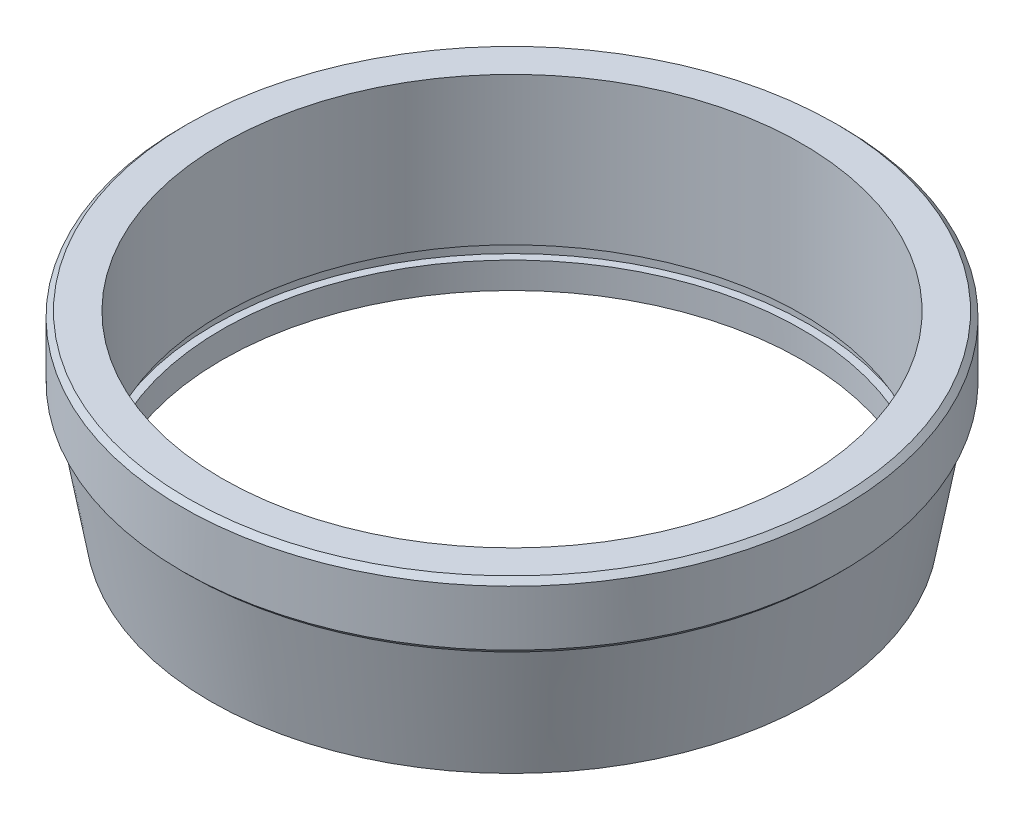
ISO-10303-21;
HEADER;
FILE_DESCRIPTION(('STEP AP214'),'2;1');
FILE_NAME('part.step','',(''),(''),'','','');
FILE_SCHEMA(('AUTOMOTIVE_DESIGN { 1 0 10303 214 1 1 1 1 }'));
ENDSEC;
DATA;
#1=APPLICATION_CONTEXT('core data for automotive mechanical design processes');
#2=APPLICATION_PROTOCOL_DEFINITION('international standard','automotive_design',2000,#1);
#3=PRODUCT_CONTEXT('',#1,'mechanical');
#4=PRODUCT('Part','Part','',(#3));
#5=PRODUCT_RELATED_PRODUCT_CATEGORY('part','',(#4));
#6=PRODUCT_DEFINITION_FORMATION('','',#4);
#7=PRODUCT_DEFINITION_CONTEXT('part definition',#1,'design');
#8=PRODUCT_DEFINITION('design','',#6,#7);
#9=PRODUCT_DEFINITION_SHAPE('','',#8);
#10=(LENGTH_UNIT() NAMED_UNIT(*) SI_UNIT(.MILLI.,.METRE.));
#11=(NAMED_UNIT(*) PLANE_ANGLE_UNIT() SI_UNIT($,.RADIAN.));
#12=(NAMED_UNIT(*) SI_UNIT($,.STERADIAN.) SOLID_ANGLE_UNIT());
#13=UNCERTAINTY_MEASURE_WITH_UNIT(LENGTH_MEASURE(1.E-05),#10,'distance_accuracy_value','');
#14=(GEOMETRIC_REPRESENTATION_CONTEXT(3) GLOBAL_UNCERTAINTY_ASSIGNED_CONTEXT((#13)) GLOBAL_UNIT_ASSIGNED_CONTEXT((#10,
#11,#12)) REPRESENTATION_CONTEXT('',''));
#15=CARTESIAN_POINT('',(0.,0.,0.));
#16=DIRECTION('',(0.,0.,1.));
#17=DIRECTION('',(1.,0.,0.));
#18=AXIS2_PLACEMENT_3D('',#15,#16,#17);
#19=CARTESIAN_POINT('',(0.,0.,0.));
#20=DIRECTION('',(0.,1.,0.));
#21=DIRECTION('',(0.,0.,1.));
#22=AXIS2_PLACEMENT_3D('',#19,#20,#21);
#23=CYLINDRICAL_SURFACE('',#22,11.);
#24=CARTESIAN_POINT('',(0.,-3.1,0.));
#25=DIRECTION('',(0.,1.,0.));
#26=DIRECTION('',(0.,0.,1.));
#27=AXIS2_PLACEMENT_3D('',#24,#25,#26);
#28=CIRCLE('',#27,11.);
#29=CARTESIAN_POINT('',(0.,-3.1,11.));
#30=VERTEX_POINT('',#29);
#31=EDGE_CURVE('E66',#30,#30,#28,.T.);
#32=ORIENTED_EDGE('',*,*,#31,.F.);
#33=EDGE_LOOP('',(#32));
#34=FACE_BOUND('',#33,.T.);
#35=CARTESIAN_POINT('',(0.,2.5,0.));
#36=DIRECTION('',(0.,1.,0.));
#37=DIRECTION('',(0.,0.,1.));
#38=AXIS2_PLACEMENT_3D('',#35,#36,#37);
#39=CIRCLE('',#38,11.);
#40=CARTESIAN_POINT('',(0.,2.5,11.));
#41=VERTEX_POINT('',#40);
#42=EDGE_CURVE('E57',#41,#41,#39,.T.);
#43=ORIENTED_EDGE('',*,*,#42,.T.);
#44=EDGE_LOOP('',(#43));
#45=FACE_BOUND('',#44,.T.);
#46=ADVANCED_FACE('F31',(#34,#45),#23,.F.);
#47=CARTESIAN_POINT('',(0.,0.,0.));
#48=DIRECTION('',(0.,1.,0.));
#49=DIRECTION('',(0.,0.,1.));
#50=AXIS2_PLACEMENT_3D('',#47,#48,#49);
#51=CONICAL_SURFACE('',#50,12.25,0.174532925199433);
#52=CARTESIAN_POINT('',(0.,-4.6,0.));
#53=DIRECTION('',(0.,1.,0.));
#54=DIRECTION('',(0.,0.,1.));
#55=AXIS2_PLACEMENT_3D('',#52,#53,#54);
#56=CIRCLE('',#55,11.4388958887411);
#57=CARTESIAN_POINT('',(0.,-4.6,11.4388958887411));
#58=VERTEX_POINT('',#57);
#59=EDGE_CURVE('E51',#58,#58,#56,.T.);
#60=ORIENTED_EDGE('',*,*,#59,.T.);
#61=EDGE_LOOP('',(#60));
#62=FACE_BOUND('',#61,.T.);
#63=CARTESIAN_POINT('',(0.,0.,0.));
#64=DIRECTION('',(0.,1.,0.));
#65=DIRECTION('',(0.,0.,1.));
#66=AXIS2_PLACEMENT_3D('',#63,#64,#65);
#67=CIRCLE('',#66,12.25);
#68=CARTESIAN_POINT('',(0.,0.,12.25));
#69=VERTEX_POINT('',#68);
#70=EDGE_CURVE('E54',#69,#69,#67,.T.);
#71=ORIENTED_EDGE('',*,*,#70,.F.);
#72=EDGE_LOOP('',(#71));
#73=FACE_BOUND('',#72,.T.);
#74=ADVANCED_FACE('F93',(#62,#73),#51,.T.);
#75=CARTESIAN_POINT('',(0.,-4.6,0.));
#76=DIRECTION('',(0.,1.,0.));
#77=DIRECTION('',(0.,0.,1.));
#78=AXIS2_PLACEMENT_3D('',#75,#76,#77);
#79=PLANE('',#78);
#80=CARTESIAN_POINT('',(0.,-4.6,0.));
#81=DIRECTION('',(0.,-1.,0.));
#82=DIRECTION('',(0.,0.,-1.));
#83=AXIS2_PLACEMENT_3D('',#80,#81,#82);
#84=CIRCLE('',#83,11.);
#85=CARTESIAN_POINT('',(0.,-4.6,-11.));
#86=VERTEX_POINT('',#85);
#87=EDGE_CURVE('E60',#86,#86,#84,.T.);
#88=ORIENTED_EDGE('',*,*,#87,.F.);
#89=EDGE_LOOP('',(#88));
#90=FACE_BOUND('',#89,.T.);
#91=ORIENTED_EDGE('',*,*,#59,.F.);
#92=EDGE_LOOP('',(#91));
#93=FACE_BOUND('',#92,.T.);
#94=ADVANCED_FACE('F108',(#90,#93),#79,.F.);
#95=CARTESIAN_POINT('',(0.,2.5,0.));
#96=DIRECTION('',(0.,-1.,0.));
#97=DIRECTION('',(0.,0.,-1.));
#98=AXIS2_PLACEMENT_3D('',#95,#96,#97);
#99=CYLINDRICAL_SURFACE('',#98,12.5);
#100=CARTESIAN_POINT('',(0.,0.199999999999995,0.));
#101=DIRECTION('',(0.,1.,0.));
#102=DIRECTION('',(0.,0.,1.));
#103=AXIS2_PLACEMENT_3D('',#100,#101,#102);
#104=CIRCLE('',#103,12.5);
#105=CARTESIAN_POINT('',(0.,0.199999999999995,12.5));
#106=VERTEX_POINT('',#105);
#107=EDGE_CURVE('E42',#106,#106,#104,.T.);
#108=ORIENTED_EDGE('',*,*,#107,.T.);
#109=EDGE_LOOP('',(#108));
#110=FACE_BOUND('',#109,.T.);
#111=CARTESIAN_POINT('',(0.,2.30000000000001,0.));
#112=DIRECTION('',(0.,1.,0.));
#113=DIRECTION('',(0.,0.,1.));
#114=AXIS2_PLACEMENT_3D('',#111,#112,#113);
#115=CIRCLE('',#114,12.5);
#116=CARTESIAN_POINT('',(0.,2.30000000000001,-12.5));
#117=VERTEX_POINT('',#116);
#118=EDGE_CURVE('E46',#117,#117,#115,.F.);
#119=ORIENTED_EDGE('',*,*,#118,.T.);
#120=EDGE_LOOP('',(#119));
#121=FACE_BOUND('',#120,.T.);
#122=ADVANCED_FACE('F100',(#110,#121),#99,.T.);
#123=CARTESIAN_POINT('',(0.,2.5,0.));
#124=DIRECTION('',(0.,1.,0.));
#125=DIRECTION('',(0.,0.,1.));
#126=AXIS2_PLACEMENT_3D('',#123,#124,#125);
#127=PLANE('',#126);
#128=ORIENTED_EDGE('',*,*,#42,.F.);
#129=EDGE_LOOP('',(#128));
#130=FACE_BOUND('',#129,.T.);
#131=CARTESIAN_POINT('',(0.,2.5,0.));
#132=DIRECTION('',(0.,1.,0.));
#133=DIRECTION('',(0.,0.,1.));
#134=AXIS2_PLACEMENT_3D('',#131,#132,#133);
#135=CIRCLE('',#134,12.3);
#136=CARTESIAN_POINT('',(0.,2.5,-12.3));
#137=VERTEX_POINT('',#136);
#138=EDGE_CURVE('E10',#137,#137,#135,.T.);
#139=ORIENTED_EDGE('',*,*,#138,.T.);
#140=EDGE_LOOP('',(#139));
#141=FACE_BOUND('',#140,.T.);
#142=ADVANCED_FACE('F97',(#130,#141),#127,.T.);
#143=CARTESIAN_POINT('',(0.,0.,0.));
#144=DIRECTION('',(0.,1.,0.));
#145=DIRECTION('',(0.,0.,1.));
#146=AXIS2_PLACEMENT_3D('',#143,#144,#145);
#147=PLANE('',#146);
#148=CARTESIAN_POINT('',(0.,0.,0.));
#149=DIRECTION('',(0.,1.,0.));
#150=DIRECTION('',(0.,0.,1.));
#151=AXIS2_PLACEMENT_3D('',#148,#149,#150);
#152=CIRCLE('',#151,12.3);
#153=CARTESIAN_POINT('',(0.,0.,12.3));
#154=VERTEX_POINT('',#153);
#155=EDGE_CURVE('E38',#154,#154,#152,.F.);
#156=ORIENTED_EDGE('',*,*,#155,.T.);
#157=EDGE_LOOP('',(#156));
#158=FACE_BOUND('',#157,.T.);
#159=ORIENTED_EDGE('',*,*,#70,.T.);
#160=EDGE_LOOP('',(#159));
#161=FACE_BOUND('',#160,.T.);
#162=ADVANCED_FACE('F99',(#158,#161),#147,.F.);
#163=CARTESIAN_POINT('',(0.,0.199999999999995,0.));
#164=DIRECTION('',(0.,1.,0.));
#165=DIRECTION('',(0.,0.,1.));
#166=AXIS2_PLACEMENT_3D('',#163,#164,#165);
#167=CONICAL_SURFACE('',#166,12.5,0.785398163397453);
#168=ORIENTED_EDGE('',*,*,#155,.F.);
#169=EDGE_LOOP('',(#168));
#170=FACE_BOUND('',#169,.T.);
#171=ORIENTED_EDGE('',*,*,#107,.F.);
#172=EDGE_LOOP('',(#171));
#173=FACE_BOUND('',#172,.T.);
#174=ADVANCED_FACE('F106',(#170,#173),#167,.T.);
#175=CARTESIAN_POINT('',(0.,2.5,0.));
#176=DIRECTION('',(0.,-1.,0.));
#177=DIRECTION('',(0.,0.,-1.));
#178=AXIS2_PLACEMENT_3D('',#175,#176,#177);
#179=CONICAL_SURFACE('',#178,12.3,0.785398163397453);
#180=CARTESIAN_POINT('',(0.,2.30000000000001,-12.5));
#181=CARTESIAN_POINT('',(0.,2.30208333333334,-12.4979166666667));
#182=CARTESIAN_POINT('',(0.,2.30416666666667,-12.4958333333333));
#183=CARTESIAN_POINT('',(0.,2.30833333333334,-12.4916666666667));
#184=CARTESIAN_POINT('',(0.,2.31041666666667,-12.4895833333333));
#185=CARTESIAN_POINT('',(0.,2.31458333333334,-12.4854166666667));
#186=CARTESIAN_POINT('',(0.,2.31666666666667,-12.4833333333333));
#187=CARTESIAN_POINT('',(0.,2.32083333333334,-12.4791666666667));
#188=CARTESIAN_POINT('',(0.,2.32291666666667,-12.4770833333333));
#189=CARTESIAN_POINT('',(0.,2.32708333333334,-12.4729166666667));
#190=CARTESIAN_POINT('',(0.,2.32916666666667,-12.4708333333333));
#191=CARTESIAN_POINT('',(0.,2.33333333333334,-12.4666666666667));
#192=CARTESIAN_POINT('',(0.,2.33541666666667,-12.4645833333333));
#193=CARTESIAN_POINT('',(0.,2.33958333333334,-12.4604166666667));
#194=CARTESIAN_POINT('',(0.,2.34166666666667,-12.4583333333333));
#195=CARTESIAN_POINT('',(0.,2.34583333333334,-12.4541666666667));
#196=CARTESIAN_POINT('',(0.,2.34791666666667,-12.4520833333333));
#197=CARTESIAN_POINT('',(0.,2.35208333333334,-12.4479166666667));
#198=CARTESIAN_POINT('',(0.,2.35416666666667,-12.4458333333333));
#199=CARTESIAN_POINT('',(0.,2.35833333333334,-12.4416666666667));
#200=CARTESIAN_POINT('',(0.,2.36041666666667,-12.4395833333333));
#201=CARTESIAN_POINT('',(0.,2.36458333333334,-12.4354166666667));
#202=CARTESIAN_POINT('',(0.,2.36666666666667,-12.4333333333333));
#203=CARTESIAN_POINT('',(0.,2.37083333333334,-12.4291666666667));
#204=CARTESIAN_POINT('',(0.,2.37291666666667,-12.4270833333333));
#205=CARTESIAN_POINT('',(0.,2.37708333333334,-12.4229166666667));
#206=CARTESIAN_POINT('',(0.,2.37916666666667,-12.4208333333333));
#207=CARTESIAN_POINT('',(0.,2.38333333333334,-12.4166666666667));
#208=CARTESIAN_POINT('',(0.,2.38541666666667,-12.4145833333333));
#209=CARTESIAN_POINT('',(0.,2.38958333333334,-12.4104166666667));
#210=CARTESIAN_POINT('',(0.,2.39166666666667,-12.4083333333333));
#211=CARTESIAN_POINT('',(0.,2.39583333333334,-12.4041666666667));
#212=CARTESIAN_POINT('',(0.,2.39791666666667,-12.4020833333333));
#213=CARTESIAN_POINT('',(0.,2.40208333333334,-12.3979166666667));
#214=CARTESIAN_POINT('',(0.,2.40416666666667,-12.3958333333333));
#215=CARTESIAN_POINT('',(0.,2.40833333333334,-12.3916666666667));
#216=CARTESIAN_POINT('',(0.,2.41041666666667,-12.3895833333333));
#217=CARTESIAN_POINT('',(0.,2.41458333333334,-12.3854166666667));
#218=CARTESIAN_POINT('',(0.,2.41666666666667,-12.3833333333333));
#219=CARTESIAN_POINT('',(0.,2.42083333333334,-12.3791666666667));
#220=CARTESIAN_POINT('',(0.,2.42291666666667,-12.3770833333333));
#221=CARTESIAN_POINT('',(0.,2.42708333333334,-12.3729166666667));
#222=CARTESIAN_POINT('',(0.,2.42916666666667,-12.3708333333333));
#223=CARTESIAN_POINT('',(0.,2.43333333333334,-12.3666666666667));
#224=CARTESIAN_POINT('',(0.,2.43541666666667,-12.3645833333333));
#225=CARTESIAN_POINT('',(0.,2.43958333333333,-12.3604166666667));
#226=CARTESIAN_POINT('',(0.,2.44166666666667,-12.3583333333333));
#227=CARTESIAN_POINT('',(0.,2.44583333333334,-12.3541666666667));
#228=CARTESIAN_POINT('',(0.,2.44791666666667,-12.3520833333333));
#229=CARTESIAN_POINT('',(0.,2.45208333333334,-12.3479166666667));
#230=CARTESIAN_POINT('',(0.,2.45416666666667,-12.3458333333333));
#231=CARTESIAN_POINT('',(0.,2.45833333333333,-12.3416666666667));
#232=CARTESIAN_POINT('',(0.,2.46041666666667,-12.3395833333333));
#233=CARTESIAN_POINT('',(0.,2.46458333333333,-12.3354166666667));
#234=CARTESIAN_POINT('',(0.,2.46666666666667,-12.3333333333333));
#235=CARTESIAN_POINT('',(0.,2.47083333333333,-12.3291666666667));
#236=CARTESIAN_POINT('',(0.,2.47291666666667,-12.3270833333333));
#237=CARTESIAN_POINT('',(0.,2.47708333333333,-12.3229166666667));
#238=CARTESIAN_POINT('',(0.,2.47916666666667,-12.3208333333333));
#239=CARTESIAN_POINT('',(0.,2.48333333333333,-12.3166666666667));
#240=CARTESIAN_POINT('',(0.,2.48541666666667,-12.3145833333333));
#241=CARTESIAN_POINT('',(0.,2.48958333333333,-12.3104166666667));
#242=CARTESIAN_POINT('',(0.,2.49166666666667,-12.3083333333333));
#243=CARTESIAN_POINT('',(0.,2.49583333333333,-12.3041666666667));
#244=CARTESIAN_POINT('',(0.,2.49791666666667,-12.3020833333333));
#245=CARTESIAN_POINT('',(0.,2.5,-12.3));
#246=B_SPLINE_CURVE_WITH_KNOTS('',3,(#180,#181,#182,#183,#184,#185,#186,#187,#188,#189,#190,
#191,#192,#193,#194,#195,#196,#197,#198,#199,#200,#201,#202,#203,#204,#205,#206,#207,#208,#209,
#210,#211,#212,#213,#214,#215,#216,#217,#218,#219,#220,#221,#222,#223,#224,#225,#226,#227,#228,
#229,#230,#231,#232,#233,#234,#235,#236,#237,#238,#239,#240,#241,#242,#243,#244,#245),
.UNSPECIFIED.,.F.,.F.,(4,2,2,2,2,2,2,2,2,2,2,2,2,2,2,2,2,2,2,2,2,2,2,2,2,2,2,2,2,2,2,2,4),(0.,
0.00883883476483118,0.0176776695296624,0.0265165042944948,0.0353553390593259,0.0441941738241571,
0.0530330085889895,0.0618718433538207,0.0707106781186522,0.0795495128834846,0.0883883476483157,
0.0972271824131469,0.106066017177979,0.11490485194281,0.123743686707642,0.132582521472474,
0.141421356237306,0.150260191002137,0.159099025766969,0.1679378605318,0.176776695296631,
0.185615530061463,0.194454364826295,0.203293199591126,0.212132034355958,0.22097086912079,
0.229809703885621,0.238648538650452,0.247487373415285,0.256326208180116,0.265165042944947,
0.27400387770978,0.282842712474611),.UNSPECIFIED.);
#247=EDGE_CURVE('BSEAM33',#117,#137,#246,.T.);
#248=ORIENTED_EDGE('',*,*,#118,.F.);
#249=ORIENTED_EDGE('',*,*,#138,.F.);
#250=ORIENTED_EDGE('',*,*,#247,.T.);
#251=ORIENTED_EDGE('',*,*,#247,.F.);
#252=EDGE_LOOP('',(#248,#250,#249,#251));
#253=FACE_BOUND('',#252,.T.);
#254=ADVANCED_FACE('F33',(#253),#179,.T.);
#255=CARTESIAN_POINT('',(0.,-3.6,0.));
#256=DIRECTION('',(0.,1.,0.));
#257=DIRECTION('',(0.,0.,1.));
#258=AXIS2_PLACEMENT_3D('',#255,#256,#257);
#259=CIRCLE('',#258,11.);
#260=CARTESIAN_POINT('',(0.,-3.6,11.));
#261=VERTEX_POINT('',#260);
#262=EDGE_CURVE('E69',#261,#261,#259,.T.);
#263=ORIENTED_EDGE('',*,*,#262,.T.);
#264=EDGE_LOOP('',(#263));
#265=FACE_BOUND('',#264,.T.);
#266=ORIENTED_EDGE('',*,*,#87,.T.);
#267=EDGE_LOOP('',(#266));
#268=FACE_BOUND('',#267,.T.);
#269=ADVANCED_FACE('F82',(#265,#268),#23,.F.);
#270=CARTESIAN_POINT('',(0.,2.5,0.));
#271=DIRECTION('',(0.,1.,0.));
#272=DIRECTION('',(0.,0.,1.));
#273=AXIS2_PLACEMENT_3D('',#270,#271,#272);
#274=CYLINDRICAL_SURFACE('',#273,11.3);
#275=CARTESIAN_POINT('',(0.,-3.6,0.));
#276=DIRECTION('',(0.,1.,0.));
#277=DIRECTION('',(0.,0.,1.));
#278=AXIS2_PLACEMENT_3D('',#275,#276,#277);
#279=CIRCLE('',#278,11.3);
#280=CARTESIAN_POINT('',(0.,-3.6,11.3));
#281=VERTEX_POINT('',#280);
#282=EDGE_CURVE('E72',#281,#281,#279,.T.);
#283=ORIENTED_EDGE('',*,*,#282,.F.);
#284=EDGE_LOOP('',(#283));
#285=FACE_BOUND('',#284,.T.);
#286=CARTESIAN_POINT('',(0.,-3.1,0.));
#287=DIRECTION('',(0.,1.,0.));
#288=DIRECTION('',(0.,0.,1.));
#289=AXIS2_PLACEMENT_3D('',#286,#287,#288);
#290=CIRCLE('',#289,11.3);
#291=CARTESIAN_POINT('',(0.,-3.1,11.3));
#292=VERTEX_POINT('',#291);
#293=EDGE_CURVE('E63',#292,#292,#290,.T.);
#294=ORIENTED_EDGE('',*,*,#293,.T.);
#295=EDGE_LOOP('',(#294));
#296=FACE_BOUND('',#295,.T.);
#297=ADVANCED_FACE('F78',(#285,#296),#274,.F.);
#298=CARTESIAN_POINT('',(-11.3,-3.1,0.));
#299=DIRECTION('',(0.,1.,0.));
#300=DIRECTION('',(0.,0.,1.));
#301=AXIS2_PLACEMENT_3D('',#298,#299,#300);
#302=PLANE('',#301);
#303=ORIENTED_EDGE('',*,*,#293,.F.);
#304=EDGE_LOOP('',(#303));
#305=FACE_BOUND('',#304,.T.);
#306=ORIENTED_EDGE('',*,*,#31,.T.);
#307=EDGE_LOOP('',(#306));
#308=FACE_BOUND('',#307,.T.);
#309=ADVANCED_FACE('F81',(#305,#308),#302,.F.);
#310=CARTESIAN_POINT('',(-11.3,-3.6,0.));
#311=DIRECTION('',(0.,-1.,0.));
#312=DIRECTION('',(0.,0.,-1.));
#313=AXIS2_PLACEMENT_3D('',#310,#311,#312);
#314=PLANE('',#313);
#315=ORIENTED_EDGE('',*,*,#262,.F.);
#316=EDGE_LOOP('',(#315));
#317=FACE_BOUND('',#316,.T.);
#318=ORIENTED_EDGE('',*,*,#282,.T.);
#319=EDGE_LOOP('',(#318));
#320=FACE_BOUND('',#319,.T.);
#321=ADVANCED_FACE('F76',(#317,#320),#314,.F.);
#322=CLOSED_SHELL('',(#46,#74,#94,#122,#142,#162,#174,#254,#269,#297,#309,#321));
#323=MANIFOLD_SOLID_BREP('B2',#322);
#324=ADVANCED_BREP_SHAPE_REPRESENTATION('',(#18,#323),#14);
#325=SHAPE_DEFINITION_REPRESENTATION(#9,#324);
ENDSEC;
END-ISO-10303-21;
